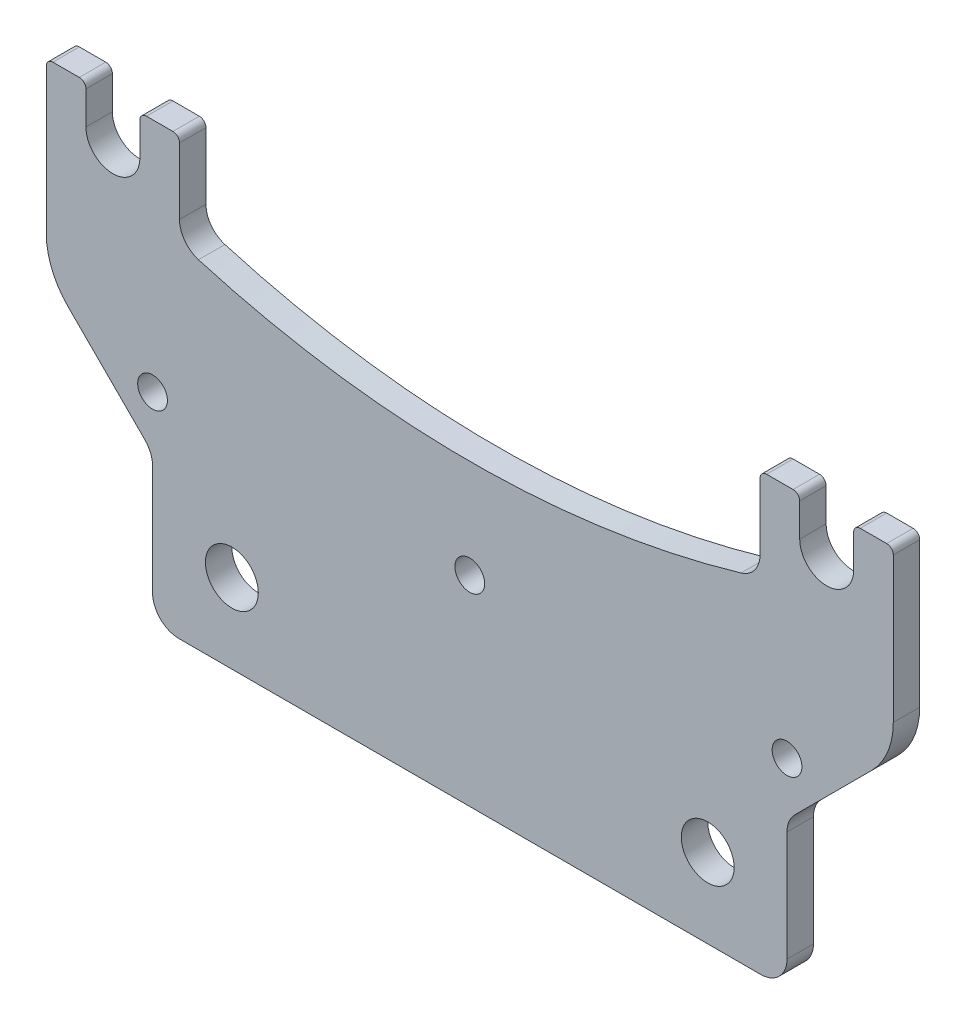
from build123d import *

# Parameters (mm, degrees)
SKETCH1_R               = 6.35
BOSS_EXTRUDE1_DEPTH     = 6.35
CUT_EXTRUDE1_DEPTH      = 211.359542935
F_1_4_CLEARANCE_HOLE1_D = 7.14248
FILLET1_R               = 17.842003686
FILLET2_R               = 1.5875
FILLET3_R               = 6.35


with BuildPart() as part:
    # Sketch1 → Boss-Extrude1 (new body)
    with BuildSketch(Plane.XY):
        with BuildLine():
            Line((-16.002, 4.7625), (-16.002, -69.723))
            Line((-16.002, -69.723), (9.525, -95.25))
            Line((9.525, -95.25), (161.925, -95.25))
            Line((161.925, -95.25), (187.452, -69.723))
            Line((187.452, -69.723), (187.452, 4.7625))
            Line((187.452, 4.7625), (187.452, 9.525))
            Line((187.452, 9.525), (177.927, 9.525))
            Line((177.927, 9.525), (177.927, 4.7625))
            Line((177.927, 4.7625), (177.927, 0))
            ThreePointArc((177.927, 0), (171.45, -6.477), (164.973, 0))
            Line((164.973, 0), (164.973, 4.7625))
            Line((164.973, 4.7625), (164.973, 9.525))
            Line((164.973, 9.525), (155.448, 9.525))
            Line((155.448, 9.525), (155.448, 4.7625))
            Line((155.448, 4.7625), (155.448, 0))
            Line((155.448, 0), (155.448, -12.7))
            ThreePointArc((155.448, -12.7), (85.725, -23.454113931), (16.002, -12.7))
            Line((16.002, -12.7), (16.002, 0))
            Line((16.002, 0), (16.002, 4.7625))
            Line((16.002, 4.7625), (16.002, 9.525))
            Line((16.002, 9.525), (6.477, 9.525))
            Line((6.477, 9.525), (6.477, 4.7625))
            Line((6.477, 4.7625), (6.477, 0))
            ThreePointArc((6.477, 0), (0, -6.477), (-6.477, 0))
            Line((-6.477, 0), (-6.477, 4.7625))
            Line((-6.477, 4.7625), (-6.477, 9.525))
            Line((-6.477, 9.525), (-16.002, 9.525))
            Line((-16.002, 9.525), (-16.002, 4.7625))
        make_face()
        with Locations((28.575, -76.2)):
            Circle(SKETCH1_R, mode=Mode.SUBTRACT)
        with Locations(Location((142.875, -76.2, 0), (0, 0, 180))):
            Circle(SKETCH1_R, mode=Mode.SUBTRACT)
    extrude(amount=BOSS_EXTRUDE1_DEPTH)

    # Sketch4 → Cut-Extrude1 (cut, through all)
    with BuildSketch(Plane.XY.offset(6.35)):
        Polygon((9.525, -95.25), (9.525, -59.817), (-16.002, -34.29), (-54.102, -34.29), (-54.102, -95.25), align=None)
        Polygon((225.552, -95.25), (161.925, -95.25), (161.925, -59.817), (187.452, -34.29), (225.552, -34.29), align=None)
    extrude(amount=-CUT_EXTRUDE1_DEPTH, mode=Mode.SUBTRACT)

    # 1_4 Clearance Hole1 (through all)
    with Locations(Plane.XY.offset(6.35)):
        with Locations((9.525, -47.117), (85.725, -47.117), (161.925, -47.117)):
            Hole(F_1_4_CLEARANCE_HOLE1_D / 2)

    # Fillet1
    fillet1_edges = [part.edges().sort_by_distance(p)[0] for p in [
        (187.452, -34.29, 3.175),
        (-16.002, -34.29, 3.175),
    ]]
    fillet(fillet1_edges, radius=FILLET1_R)

    # Fillet2
    fillet2_edges = [part.edges().sort_by_distance(p)[0] for p in [
        (155.448, 9.525, 3.175),
        (164.973, 9.525, 3.175),
        (177.927, 9.525, 3.175),
        (187.452, 9.525, 3.175),
        (-16.002, 9.525, 3.175),
        (-6.477, 9.525, 3.175),
        (6.477, 9.525, 3.175),
        (16.002, 9.525, 3.175),
    ]]
    fillet(fillet2_edges, radius=FILLET2_R)

    # Fillet3
    fillet3_edges = [part.edges().sort_by_distance(p)[0] for p in [
        (161.925, -59.817, 3.175),
        (161.925, -95.25, 3.175),
        (9.525, -95.25, 3.175),
        (16.002, -12.7, 3.175),
        (155.448, -12.7, 3.175),
        (9.525, -59.817, 3.175),
    ]]
    fillet(fillet3_edges, radius=FILLET3_R)


solid = part.part
